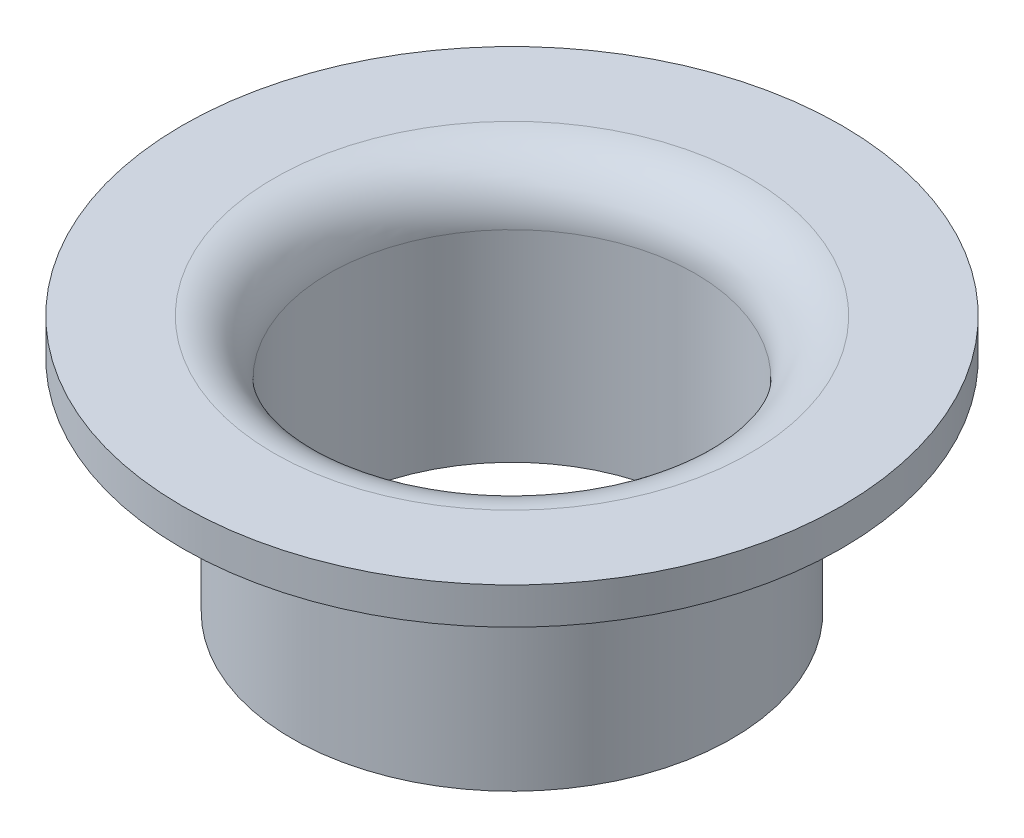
from build123d import *


with BuildPart() as part:
    # Esquisse2 → R_volution1 (revolve)
    with BuildSketch(Plane.XY, mode=Mode.PRIVATE) as r_volution1_sk:
        with BuildLine():
            Line((6, 32.645518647), (5, 32.645518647))
            Line((5, 32.645518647), (5, 38.145518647))
            ThreePointArc((5, 38.145518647), (5.439339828, 39.206178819), (6.5, 39.645518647))
            Line((6.5, 39.645518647), (9, 39.645518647))
            Line((9, 39.645518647), (9, 38.645518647))
            Line((9, 38.645518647), (6.5, 38.645518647))
            ThreePointArc((6.5, 38.645518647), (6.146446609, 38.499072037), (6, 38.145518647))
            Line((6, 38.145518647), (6, 32.645518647))
        make_face()
    revolve(r_volution1_sk.sketch.rotate(Axis((0, 0, 0), (0, 1, 0)), 90), axis=Axis((0, 0, 0), (0, 1, 0)))


solid = part.part
